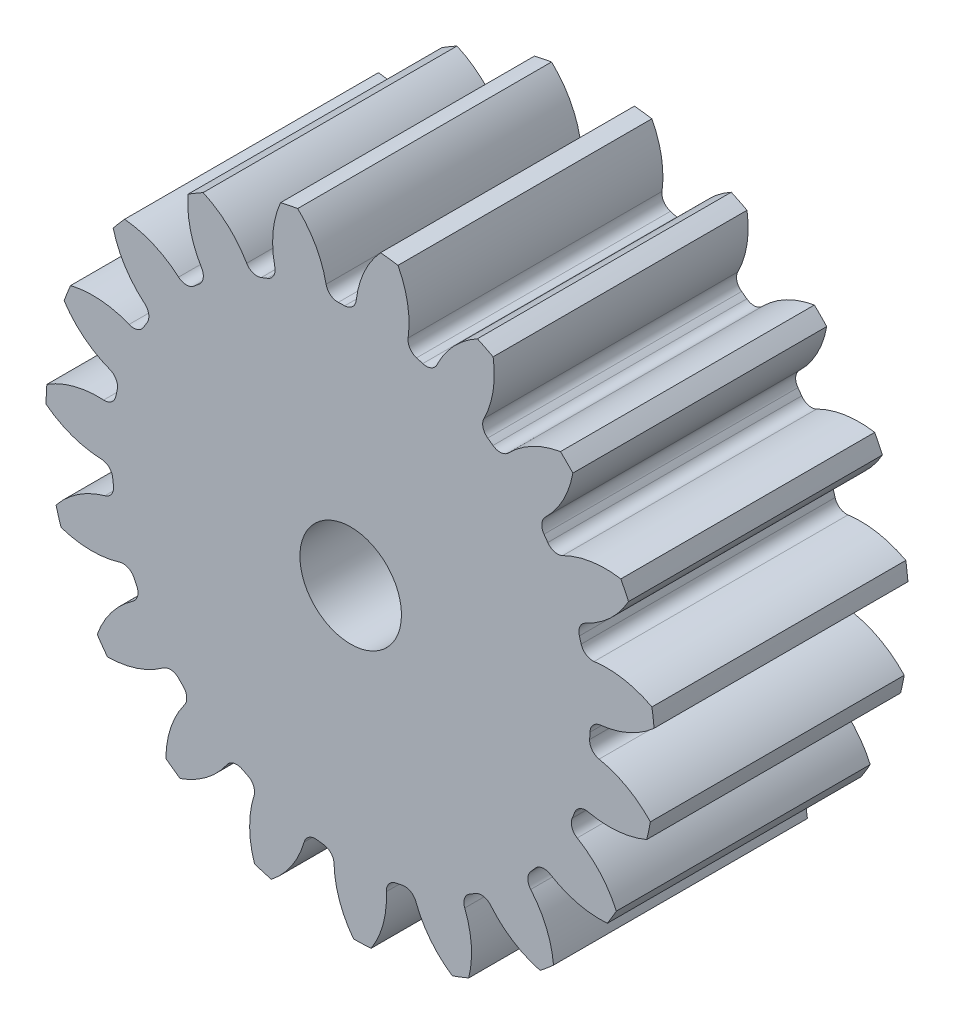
from build123d import *

# Parameters (mm, degrees)
SKETCH3_R         = 106.68
GEARBODY_DEPTH    = 88.9
TOOTHCUT_DEPTH    = 176.112691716
CIRPATTERN1_COUNT = 19
BOREDIA_R         = 17.78
BORE_DEPTH        = 12700


with BuildPart() as part:
    # Sketch3 → gearBody (new body)
    with BuildSketch(Plane.XY):
        Circle(SKETCH3_R)
    extrude(amount=GEARBODY_DEPTH)

    # Sketch2 → toothCut (cut, through all)
    with BuildSketch(Plane.XY):
        with BuildLine():
            ThreePointArc((83.679497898, -4.851188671), (83.737553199, -3.716797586), (83.78023097, -2.58172395))
            ThreePointArc((83.78023097, -2.58172395), (84.876490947, 0.09741549), (87.461001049, 1.401210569))
            ThreePointArc((87.461001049, 1.401210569), (97.785505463, 4.260421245), (106.68, 10.231890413))
            ThreePointArc((106.68, 10.231890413), (107.064143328, -4.752177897), (105.353952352, -19.643286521))
            ThreePointArc((105.353952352, -19.643286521), (97.023495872, -12.907266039), (86.992913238, -9.144568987))
            ThreePointArc((86.992913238, -9.144568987), (84.534080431, -7.616918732), (83.679497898, -4.851188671))
        make_face()
    toothcut = extrude(amount=TOOTHCUT_DEPTH, mode=Mode.SUBTRACT)

    # CirPattern1: toothCut ×19 about axis
    cirpattern1_axis = Axis((0, 0, 0), (0, 0, 1))
    for i in range(1, CIRPATTERN1_COUNT):
        add(toothcut.rotate(cirpattern1_axis, i * 360 / CIRPATTERN1_COUNT), mode=Mode.SUBTRACT)

    # boreDia → bore (cut, symmetric)
    with BuildSketch(Plane.XY):
        Circle(BOREDIA_R)
    extrude(amount=BORE_DEPTH, both=True, mode=Mode.SUBTRACT)


solid = part.part
